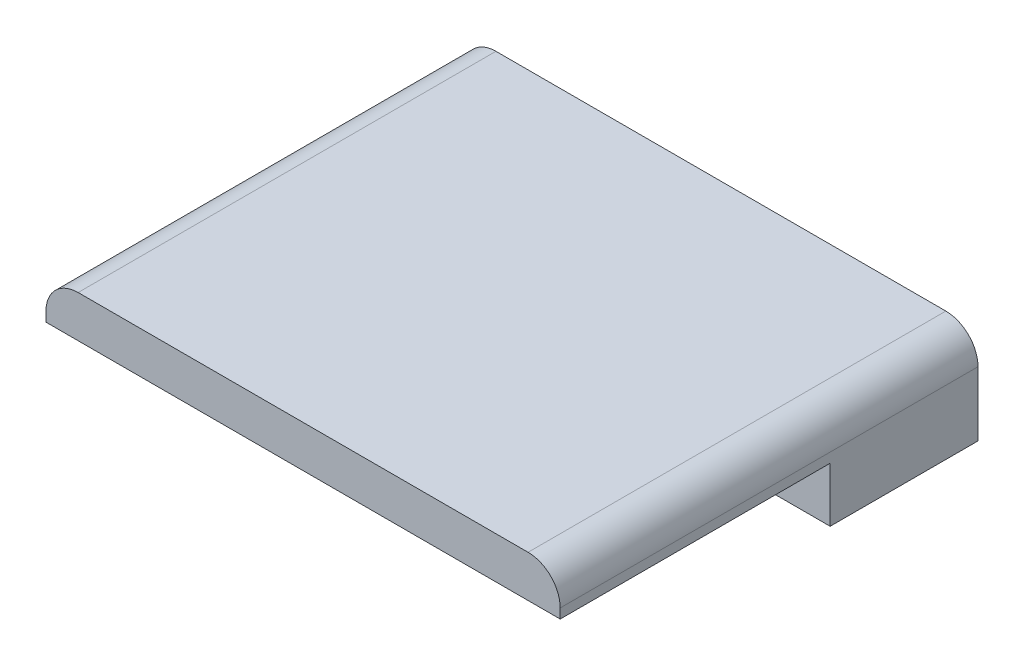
ISO-10303-21;
HEADER;
FILE_DESCRIPTION(('STEP AP214'),'2;1');
FILE_NAME('part.step','',(''),(''),'','','');
FILE_SCHEMA(('AUTOMOTIVE_DESIGN { 1 0 10303 214 1 1 1 1 }'));
ENDSEC;
DATA;
#1=APPLICATION_CONTEXT('core data for automotive mechanical design processes');
#2=APPLICATION_PROTOCOL_DEFINITION('international standard','automotive_design',2000,#1);
#3=PRODUCT_CONTEXT('',#1,'mechanical');
#4=PRODUCT('Part','Part','',(#3));
#5=PRODUCT_RELATED_PRODUCT_CATEGORY('part','',(#4));
#6=PRODUCT_DEFINITION_FORMATION('','',#4);
#7=PRODUCT_DEFINITION_CONTEXT('part definition',#1,'design');
#8=PRODUCT_DEFINITION('design','',#6,#7);
#9=PRODUCT_DEFINITION_SHAPE('','',#8);
#10=(LENGTH_UNIT() NAMED_UNIT(*) SI_UNIT(.MILLI.,.METRE.));
#11=(NAMED_UNIT(*) PLANE_ANGLE_UNIT() SI_UNIT($,.RADIAN.));
#12=(NAMED_UNIT(*) SI_UNIT($,.STERADIAN.) SOLID_ANGLE_UNIT());
#13=UNCERTAINTY_MEASURE_WITH_UNIT(LENGTH_MEASURE(1.E-05),#10,'distance_accuracy_value','');
#14=(GEOMETRIC_REPRESENTATION_CONTEXT(3) GLOBAL_UNCERTAINTY_ASSIGNED_CONTEXT((#13)) GLOBAL_UNIT_ASSIGNED_CONTEXT((#10,
#11,#12)) REPRESENTATION_CONTEXT('',''));
#15=CARTESIAN_POINT('',(0.,0.,0.));
#16=DIRECTION('',(0.,0.,1.));
#17=DIRECTION('',(1.,0.,0.));
#18=AXIS2_PLACEMENT_3D('',#15,#16,#17);
#19=CARTESIAN_POINT('',(-40.,0.,65.));
#20=DIRECTION('',(1.,0.,0.));
#21=DIRECTION('',(0.,0.,-1.));
#22=AXIS2_PLACEMENT_3D('',#19,#20,#21);
#23=PLANE('',#22);
#24=DIRECTION('',(0.,-1.,0.));
#25=VECTOR('',#24,1.);
#26=CARTESIAN_POINT('',(-40.,0.,65.));
#27=LINE('',#26,#25);
#28=CARTESIAN_POINT('',(-40.,9.99999999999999,65.));
#29=VERTEX_POINT('',#28);
#30=CARTESIAN_POINT('',(-40.,8.5,65.));
#31=VERTEX_POINT('',#30);
#32=EDGE_CURVE('E146',#29,#31,#27,.T.);
#33=ORIENTED_EDGE('',*,*,#32,.F.);
#34=DIRECTION('',(0.,0.,-1.));
#35=VECTOR('',#34,1.);
#36=CARTESIAN_POINT('',(-40.,9.99999999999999,65.));
#37=LINE('',#36,#35);
#38=CARTESIAN_POINT('',(-40.,9.99999999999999,0.));
#39=VERTEX_POINT('',#38);
#40=EDGE_CURVE('E126',#29,#39,#37,.T.);
#41=ORIENTED_EDGE('',*,*,#40,.T.);
#42=DIRECTION('',(0.,-1.,0.));
#43=VECTOR('',#42,1.);
#44=CARTESIAN_POINT('',(-40.,0.,0.));
#45=LINE('',#44,#43);
#46=CARTESIAN_POINT('',(-40.,0.,0.));
#47=VERTEX_POINT('',#46);
#48=EDGE_CURVE('E125',#39,#47,#45,.T.);
#49=ORIENTED_EDGE('',*,*,#48,.T.);
#50=DIRECTION('',(0.,0.,-1.));
#51=VECTOR('',#50,1.);
#52=CARTESIAN_POINT('',(-40.,0.,65.));
#53=LINE('',#52,#51);
#54=CARTESIAN_POINT('',(-40.,0.,23.));
#55=VERTEX_POINT('',#54);
#56=EDGE_CURVE('E118',#55,#47,#53,.T.);
#57=ORIENTED_EDGE('',*,*,#56,.F.);
#58=DIRECTION('',(0.,1.,0.));
#59=VECTOR('',#58,1.);
#60=CARTESIAN_POINT('',(-40.,8.5,23.));
#61=LINE('',#60,#59);
#62=CARTESIAN_POINT('',(-40.,8.5,23.));
#63=VERTEX_POINT('',#62);
#64=EDGE_CURVE('E99',#55,#63,#61,.T.);
#65=ORIENTED_EDGE('',*,*,#64,.T.);
#66=DIRECTION('',(0.,0.,1.));
#67=VECTOR('',#66,1.);
#68=CARTESIAN_POINT('',(-40.,8.5,65.));
#69=LINE('',#68,#67);
#70=EDGE_CURVE('E110',#63,#31,#69,.T.);
#71=ORIENTED_EDGE('',*,*,#70,.T.);
#72=EDGE_LOOP('',(#33,#41,#49,#57,#65,#71));
#73=FACE_BOUND('',#72,.T.);
#74=ADVANCED_FACE('F33',(#73),#23,.F.);
#75=CARTESIAN_POINT('',(-40.,0.,65.));
#76=DIRECTION('',(0.,1.,0.));
#77=DIRECTION('',(-1.,0.,0.));
#78=AXIS2_PLACEMENT_3D('',#75,#76,#77);
#79=PLANE('',#78);
#80=DIRECTION('',(0.,0.,-1.));
#81=VECTOR('',#80,1.);
#82=CARTESIAN_POINT('',(40.,0.,65.));
#83=LINE('',#82,#81);
#84=CARTESIAN_POINT('',(40.,0.,23.));
#85=VERTEX_POINT('',#84);
#86=CARTESIAN_POINT('',(40.,0.,0.));
#87=VERTEX_POINT('',#86);
#88=EDGE_CURVE('E120',#85,#87,#83,.T.);
#89=ORIENTED_EDGE('',*,*,#88,.F.);
#90=DIRECTION('',(1.,0.,0.));
#91=VECTOR('',#90,1.);
#92=CARTESIAN_POINT('',(-40.,0.,23.));
#93=LINE('',#92,#91);
#94=EDGE_CURVE('E103',#55,#85,#93,.T.);
#95=ORIENTED_EDGE('',*,*,#94,.F.);
#96=ORIENTED_EDGE('',*,*,#56,.T.);
#97=DIRECTION('',(1.,0.,0.));
#98=VECTOR('',#97,1.);
#99=CARTESIAN_POINT('',(-40.,0.,0.));
#100=LINE('',#99,#98);
#101=EDGE_CURVE('E160',#47,#87,#100,.T.);
#102=ORIENTED_EDGE('',*,*,#101,.T.);
#103=EDGE_LOOP('',(#89,#95,#96,#102));
#104=FACE_BOUND('',#103,.T.);
#105=ADVANCED_FACE('F116',(#104),#79,.F.);
#106=CARTESIAN_POINT('',(40.,0.,65.));
#107=DIRECTION('',(-1.,0.,0.));
#108=DIRECTION('',(0.,0.,1.));
#109=AXIS2_PLACEMENT_3D('',#106,#107,#108);
#110=PLANE('',#109);
#111=DIRECTION('',(0.,1.,0.));
#112=VECTOR('',#111,1.);
#113=CARTESIAN_POINT('',(40.,0.,0.));
#114=LINE('',#113,#112);
#115=CARTESIAN_POINT('',(40.,9.99999999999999,0.));
#116=VERTEX_POINT('',#115);
#117=EDGE_CURVE('E159',#87,#116,#114,.T.);
#118=ORIENTED_EDGE('',*,*,#117,.T.);
#119=DIRECTION('',(0.,0.,-1.));
#120=VECTOR('',#119,1.);
#121=CARTESIAN_POINT('',(40.,9.99999999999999,65.));
#122=LINE('',#121,#120);
#123=CARTESIAN_POINT('',(40.,9.99999999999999,65.));
#124=VERTEX_POINT('',#123);
#125=EDGE_CURVE('E11',#116,#124,#122,.F.);
#126=ORIENTED_EDGE('',*,*,#125,.T.);
#127=DIRECTION('',(0.,1.,0.));
#128=VECTOR('',#127,1.);
#129=CARTESIAN_POINT('',(40.,0.,65.));
#130=LINE('',#129,#128);
#131=CARTESIAN_POINT('',(40.,8.5,65.));
#132=VERTEX_POINT('',#131);
#133=EDGE_CURVE('E150',#132,#124,#130,.T.);
#134=ORIENTED_EDGE('',*,*,#133,.F.);
#135=DIRECTION('',(0.,0.,1.));
#136=VECTOR('',#135,1.);
#137=CARTESIAN_POINT('',(40.,8.5,65.));
#138=LINE('',#137,#136);
#139=CARTESIAN_POINT('',(40.,8.5,23.));
#140=VERTEX_POINT('',#139);
#141=EDGE_CURVE('E111',#140,#132,#138,.T.);
#142=ORIENTED_EDGE('',*,*,#141,.F.);
#143=DIRECTION('',(0.,1.,0.));
#144=VECTOR('',#143,1.);
#145=CARTESIAN_POINT('',(40.,8.5,23.));
#146=LINE('',#145,#144);
#147=EDGE_CURVE('E171',#85,#140,#146,.T.);
#148=ORIENTED_EDGE('',*,*,#147,.F.);
#149=ORIENTED_EDGE('',*,*,#88,.T.);
#150=EDGE_LOOP('',(#118,#126,#134,#142,#148,#149));
#151=FACE_BOUND('',#150,.T.);
#152=ADVANCED_FACE('F174',(#151),#110,.F.);
#153=CARTESIAN_POINT('',(-40.,15.,65.));
#154=DIRECTION('',(0.,-1.,0.));
#155=DIRECTION('',(0.,0.,-1.));
#156=AXIS2_PLACEMENT_3D('',#153,#154,#155);
#157=PLANE('',#156);
#158=DIRECTION('',(-1.,0.,0.));
#159=VECTOR('',#158,1.);
#160=CARTESIAN_POINT('',(-40.,15.,0.));
#161=LINE('',#160,#159);
#162=CARTESIAN_POINT('',(35.,15.,0.));
#163=VERTEX_POINT('',#162);
#164=CARTESIAN_POINT('',(-35.,15.,0.));
#165=VERTEX_POINT('',#164);
#166=EDGE_CURVE('E151',#163,#165,#161,.T.);
#167=ORIENTED_EDGE('',*,*,#166,.T.);
#168=DIRECTION('',(0.,0.,-1.));
#169=VECTOR('',#168,1.);
#170=CARTESIAN_POINT('',(-35.,15.,65.));
#171=LINE('',#170,#169);
#172=CARTESIAN_POINT('',(-35.,15.,65.));
#173=VERTEX_POINT('',#172);
#174=EDGE_CURVE('E54',#165,#173,#171,.F.);
#175=ORIENTED_EDGE('',*,*,#174,.T.);
#176=DIRECTION('',(-1.,0.,0.));
#177=VECTOR('',#176,1.);
#178=CARTESIAN_POINT('',(-40.,15.,65.));
#179=LINE('',#178,#177);
#180=CARTESIAN_POINT('',(35.,15.,65.));
#181=VERTEX_POINT('',#180);
#182=EDGE_CURVE('E130',#181,#173,#179,.T.);
#183=ORIENTED_EDGE('',*,*,#182,.F.);
#184=DIRECTION('',(0.,0.,-1.));
#185=VECTOR('',#184,1.);
#186=CARTESIAN_POINT('',(35.,15.,65.));
#187=LINE('',#186,#185);
#188=EDGE_CURVE('E137',#181,#163,#187,.T.);
#189=ORIENTED_EDGE('',*,*,#188,.T.);
#190=EDGE_LOOP('',(#167,#175,#183,#189));
#191=FACE_BOUND('',#190,.T.);
#192=ADVANCED_FACE('F157',(#191),#157,.F.);
#193=CARTESIAN_POINT('',(-40.,15.,65.));
#194=DIRECTION('',(0.,0.,-1.));
#195=DIRECTION('',(-1.,0.,0.));
#196=AXIS2_PLACEMENT_3D('',#193,#194,#195);
#197=PLANE('',#196);
#198=ORIENTED_EDGE('',*,*,#182,.T.);
#199=CARTESIAN_POINT('',(-35.,9.99999999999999,65.));
#200=DIRECTION('',(0.,0.,-1.));
#201=DIRECTION('',(-1.,0.,0.));
#202=AXIS2_PLACEMENT_3D('',#199,#200,#201);
#203=CIRCLE('',#202,5.);
#204=EDGE_CURVE('E41',#173,#29,#203,.F.);
#205=ORIENTED_EDGE('',*,*,#204,.T.);
#206=ORIENTED_EDGE('',*,*,#32,.T.);
#207=DIRECTION('',(1.,0.,0.));
#208=VECTOR('',#207,1.);
#209=CARTESIAN_POINT('',(-40.,8.5,65.));
#210=LINE('',#209,#208);
#211=EDGE_CURVE('E165',#31,#132,#210,.T.);
#212=ORIENTED_EDGE('',*,*,#211,.T.);
#213=ORIENTED_EDGE('',*,*,#133,.T.);
#214=CARTESIAN_POINT('',(35.,9.99999999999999,65.));
#215=DIRECTION('',(0.,0.,-1.));
#216=DIRECTION('',(-1.,0.,0.));
#217=AXIS2_PLACEMENT_3D('',#214,#215,#216);
#218=CIRCLE('',#217,5.);
#219=EDGE_CURVE('E141',#124,#181,#218,.F.);
#220=ORIENTED_EDGE('',*,*,#219,.T.);
#221=EDGE_LOOP('',(#198,#205,#206,#212,#213,#220));
#222=FACE_BOUND('',#221,.T.);
#223=ADVANCED_FACE('F144',(#222),#197,.F.);
#224=CARTESIAN_POINT('',(-40.,15.,0.));
#225=DIRECTION('',(0.,0.,-1.));
#226=DIRECTION('',(-1.,0.,0.));
#227=AXIS2_PLACEMENT_3D('',#224,#225,#226);
#228=PLANE('',#227);
#229=ORIENTED_EDGE('',*,*,#48,.F.);
#230=CARTESIAN_POINT('',(-35.,9.99999999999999,0.));
#231=DIRECTION('',(0.,0.,-1.));
#232=DIRECTION('',(-1.,0.,0.));
#233=AXIS2_PLACEMENT_3D('',#230,#231,#232);
#234=CIRCLE('',#233,5.);
#235=EDGE_CURVE('E135',#39,#165,#234,.T.);
#236=ORIENTED_EDGE('',*,*,#235,.T.);
#237=ORIENTED_EDGE('',*,*,#166,.F.);
#238=CARTESIAN_POINT('',(35.,9.99999999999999,0.));
#239=DIRECTION('',(0.,0.,-1.));
#240=DIRECTION('',(-1.,0.,0.));
#241=AXIS2_PLACEMENT_3D('',#238,#239,#240);
#242=CIRCLE('',#241,5.);
#243=EDGE_CURVE('E128',#163,#116,#242,.T.);
#244=ORIENTED_EDGE('',*,*,#243,.T.);
#245=ORIENTED_EDGE('',*,*,#117,.F.);
#246=ORIENTED_EDGE('',*,*,#101,.F.);
#247=EDGE_LOOP('',(#229,#236,#237,#244,#245,#246));
#248=FACE_BOUND('',#247,.T.);
#249=ADVANCED_FACE('F156',(#248),#228,.T.);
#250=CARTESIAN_POINT('',(-40.,8.5,65.));
#251=DIRECTION('',(0.,1.,0.));
#252=DIRECTION('',(0.,0.,1.));
#253=AXIS2_PLACEMENT_3D('',#250,#251,#252);
#254=PLANE('',#253);
#255=ORIENTED_EDGE('',*,*,#141,.T.);
#256=ORIENTED_EDGE('',*,*,#211,.F.);
#257=ORIENTED_EDGE('',*,*,#70,.F.);
#258=DIRECTION('',(1.,0.,0.));
#259=VECTOR('',#258,1.);
#260=CARTESIAN_POINT('',(-40.,8.5,23.));
#261=LINE('',#260,#259);
#262=EDGE_CURVE('E105',#63,#140,#261,.T.);
#263=ORIENTED_EDGE('',*,*,#262,.T.);
#264=EDGE_LOOP('',(#255,#256,#257,#263));
#265=FACE_BOUND('',#264,.T.);
#266=ADVANCED_FACE('F176',(#265),#254,.F.);
#267=CARTESIAN_POINT('',(-40.,8.5,23.));
#268=DIRECTION('',(0.,0.,-1.));
#269=DIRECTION('',(-1.,0.,0.));
#270=AXIS2_PLACEMENT_3D('',#267,#268,#269);
#271=PLANE('',#270);
#272=ORIENTED_EDGE('',*,*,#147,.T.);
#273=ORIENTED_EDGE('',*,*,#262,.F.);
#274=ORIENTED_EDGE('',*,*,#64,.F.);
#275=ORIENTED_EDGE('',*,*,#94,.T.);
#276=EDGE_LOOP('',(#272,#273,#274,#275));
#277=FACE_BOUND('',#276,.T.);
#278=ADVANCED_FACE('F102',(#277),#271,.F.);
#279=CARTESIAN_POINT('',(-35.,9.99999999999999,65.));
#280=DIRECTION('',(0.,0.,-1.));
#281=DIRECTION('',(-1.,0.,0.));
#282=AXIS2_PLACEMENT_3D('',#279,#280,#281);
#283=CYLINDRICAL_SURFACE('',#282,5.);
#284=ORIENTED_EDGE('',*,*,#204,.F.);
#285=ORIENTED_EDGE('',*,*,#174,.F.);
#286=ORIENTED_EDGE('',*,*,#235,.F.);
#287=ORIENTED_EDGE('',*,*,#40,.F.);
#288=EDGE_LOOP('',(#284,#285,#286,#287));
#289=FACE_BOUND('',#288,.T.);
#290=ADVANCED_FACE('F153',(#289),#283,.T.);
#291=CARTESIAN_POINT('',(35.,9.99999999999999,65.));
#292=DIRECTION('',(0.,0.,-1.));
#293=DIRECTION('',(-1.,0.,0.));
#294=AXIS2_PLACEMENT_3D('',#291,#292,#293);
#295=CYLINDRICAL_SURFACE('',#294,5.);
#296=ORIENTED_EDGE('',*,*,#219,.F.);
#297=ORIENTED_EDGE('',*,*,#125,.F.);
#298=ORIENTED_EDGE('',*,*,#243,.F.);
#299=ORIENTED_EDGE('',*,*,#188,.F.);
#300=EDGE_LOOP('',(#296,#297,#298,#299));
#301=FACE_BOUND('',#300,.T.);
#302=ADVANCED_FACE('F35',(#301),#295,.T.);
#303=CLOSED_SHELL('',(#74,#105,#152,#192,#223,#249,#266,#278,#290,#302));
#304=MANIFOLD_SOLID_BREP('B2',#303);
#305=ADVANCED_BREP_SHAPE_REPRESENTATION('',(#18,#304),#14);
#306=SHAPE_DEFINITION_REPRESENTATION(#9,#305);
ENDSEC;
END-ISO-10303-21;
